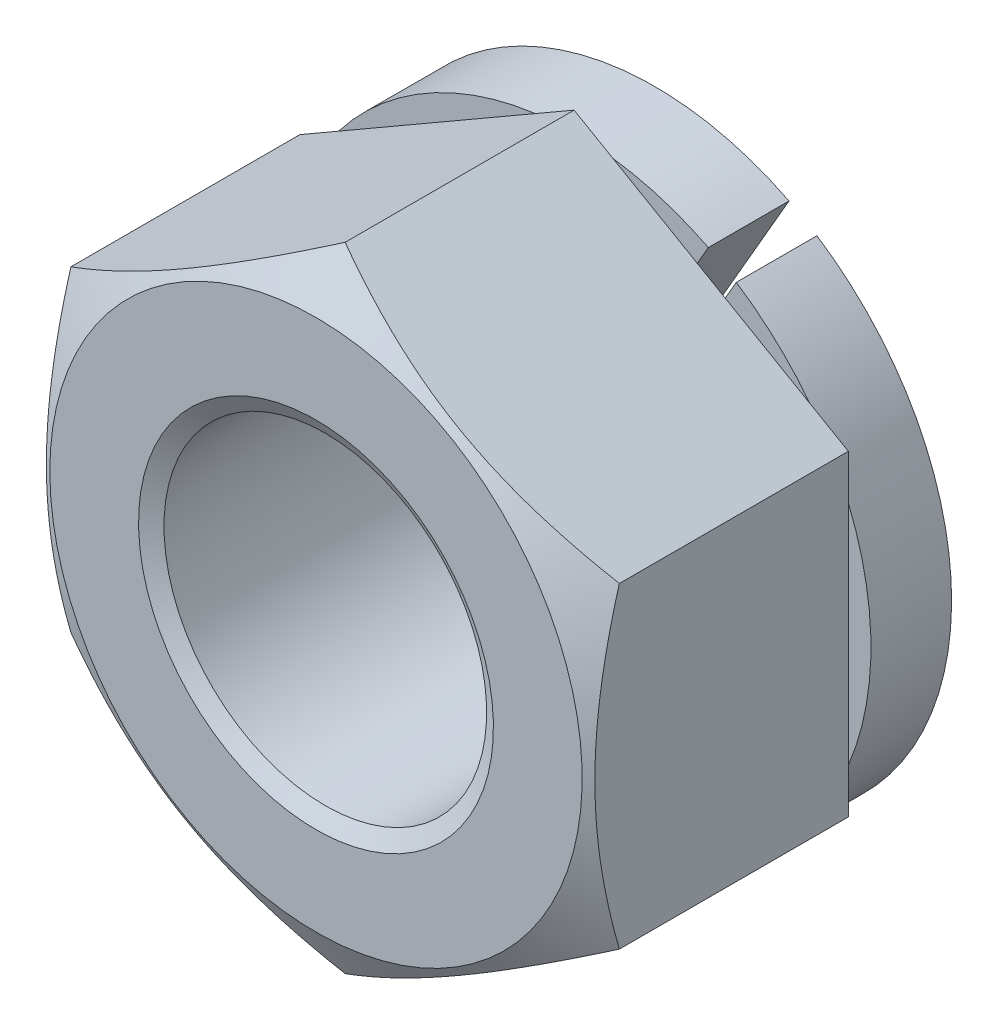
ISO-10303-21;
HEADER;
FILE_DESCRIPTION(('STEP AP214'),'2;1');
FILE_NAME('part.step','',(''),(''),'','','');
FILE_SCHEMA(('AUTOMOTIVE_DESIGN { 1 0 10303 214 1 1 1 1 }'));
ENDSEC;
DATA;
#1=APPLICATION_CONTEXT('core data for automotive mechanical design processes');
#2=APPLICATION_PROTOCOL_DEFINITION('international standard','automotive_design',2000,#1);
#3=PRODUCT_CONTEXT('',#1,'mechanical');
#4=PRODUCT('Part','Part','',(#3));
#5=PRODUCT_RELATED_PRODUCT_CATEGORY('part','',(#4));
#6=PRODUCT_DEFINITION_FORMATION('','',#4);
#7=PRODUCT_DEFINITION_CONTEXT('part definition',#1,'design');
#8=PRODUCT_DEFINITION('design','',#6,#7);
#9=PRODUCT_DEFINITION_SHAPE('','',#8);
#10=(LENGTH_UNIT() NAMED_UNIT(*) SI_UNIT(.MILLI.,.METRE.));
#11=(NAMED_UNIT(*) PLANE_ANGLE_UNIT() SI_UNIT($,.RADIAN.));
#12=(NAMED_UNIT(*) SI_UNIT($,.STERADIAN.) SOLID_ANGLE_UNIT());
#13=UNCERTAINTY_MEASURE_WITH_UNIT(LENGTH_MEASURE(1.E-05),#10,'distance_accuracy_value','');
#14=(GEOMETRIC_REPRESENTATION_CONTEXT(3) GLOBAL_UNCERTAINTY_ASSIGNED_CONTEXT((#13)) GLOBAL_UNIT_ASSIGNED_CONTEXT((#10,
#11,#12)) REPRESENTATION_CONTEXT('',''));
#15=CARTESIAN_POINT('',(0.,0.,0.));
#16=DIRECTION('',(0.,0.,1.));
#17=DIRECTION('',(1.,0.,0.));
#18=AXIS2_PLACEMENT_3D('',#15,#16,#17);
#19=CARTESIAN_POINT('',(17.,0.,2.5));
#20=DIRECTION('',(0.,0.,1.));
#21=DIRECTION('',(-0.866025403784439,0.5,0.));
#22=AXIS2_PLACEMENT_3D('',#19,#20,#21);
#23=PLANE('',#22);
#24=CARTESIAN_POINT('',(0.,0.,2.5));
#25=DIRECTION('',(0.,0.,-1.));
#26=DIRECTION('',(-0.866025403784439,0.5,0.));
#27=AXIS2_PLACEMENT_3D('',#24,#25,#26);
#28=CIRCLE('',#27,9.2);
#29=CARTESIAN_POINT('',(7.29836021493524,5.60124434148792,2.5));
#30=VERTEX_POINT('',#29);
#31=CARTESIAN_POINT('',(8.5,3.51994318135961,2.5));
#32=VERTEX_POINT('',#31);
#33=EDGE_CURVE('E9',#30,#32,#28,.T.);
#34=ORIENTED_EDGE('',*,*,#33,.F.);
#35=DIRECTION('',(-0.866025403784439,0.5,0.));
#36=VECTOR('',#35,1.);
#37=CARTESIAN_POINT('',(8.5,4.90747728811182,2.5));
#38=LINE('',#37,#36);
#39=CARTESIAN_POINT('',(8.5,4.90747728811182,2.5));
#40=VERTEX_POINT('',#39);
#41=EDGE_CURVE('E320',#40,#30,#38,.T.);
#42=ORIENTED_EDGE('',*,*,#41,.F.);
#43=DIRECTION('',(0.,1.,0.));
#44=VECTOR('',#43,1.);
#45=CARTESIAN_POINT('',(8.5,-4.90747728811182,2.5));
#46=LINE('',#45,#44);
#47=EDGE_CURVE('E397',#32,#40,#46,.T.);
#48=ORIENTED_EDGE('',*,*,#47,.F.);
#49=EDGE_LOOP('',(#34,#42,#48));
#50=FACE_BOUND('',#49,.T.);
#51=ADVANCED_FACE('F14',(#50),#23,.F.);
#52=CARTESIAN_POINT('',(8.5,-3.51994318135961,2.5));
#53=VERTEX_POINT('',#52);
#54=CARTESIAN_POINT('',(7.29836021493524,-5.60124434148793,2.5));
#55=VERTEX_POINT('',#54);
#56=EDGE_CURVE('E24',#53,#55,#28,.T.);
#57=ORIENTED_EDGE('',*,*,#56,.F.);
#58=CARTESIAN_POINT('',(8.5,-4.90747728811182,2.5));
#59=VERTEX_POINT('',#58);
#60=EDGE_CURVE('E329',#59,#53,#46,.T.);
#61=ORIENTED_EDGE('',*,*,#60,.F.);
#62=DIRECTION('',(0.866025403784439,0.5,0.));
#63=VECTOR('',#62,1.);
#64=CARTESIAN_POINT('',(0.,-9.81495457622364,2.5));
#65=LINE('',#64,#63);
#66=EDGE_CURVE('E395',#55,#59,#65,.T.);
#67=ORIENTED_EDGE('',*,*,#66,.F.);
#68=EDGE_LOOP('',(#57,#61,#67));
#69=FACE_BOUND('',#68,.T.);
#70=ADVANCED_FACE('F284',(#69),#23,.F.);
#71=CARTESIAN_POINT('',(1.20163978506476,-9.12118752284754,2.5));
#72=VERTEX_POINT('',#71);
#73=CARTESIAN_POINT('',(-1.20163978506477,-9.12118752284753,2.5));
#74=VERTEX_POINT('',#73);
#75=EDGE_CURVE('E382',#72,#74,#28,.T.);
#76=ORIENTED_EDGE('',*,*,#75,.F.);
#77=CARTESIAN_POINT('',(0.,-9.81495457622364,2.5));
#78=VERTEX_POINT('',#77);
#79=EDGE_CURVE('E396',#78,#72,#65,.T.);
#80=ORIENTED_EDGE('',*,*,#79,.F.);
#81=DIRECTION('',(0.866025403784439,-0.5,0.));
#82=VECTOR('',#81,1.);
#83=CARTESIAN_POINT('',(-8.5,-4.90747728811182,2.5));
#84=LINE('',#83,#82);
#85=EDGE_CURVE('E338',#74,#78,#84,.T.);
#86=ORIENTED_EDGE('',*,*,#85,.F.);
#87=EDGE_LOOP('',(#76,#80,#86));
#88=FACE_BOUND('',#87,.T.);
#89=ADVANCED_FACE('F424',(#88),#23,.F.);
#90=CARTESIAN_POINT('',(-7.29836021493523,-5.60124434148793,2.5));
#91=VERTEX_POINT('',#90);
#92=CARTESIAN_POINT('',(-8.5,-3.5199431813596,2.5));
#93=VERTEX_POINT('',#92);
#94=EDGE_CURVE('E378',#91,#93,#28,.T.);
#95=ORIENTED_EDGE('',*,*,#94,.F.);
#96=CARTESIAN_POINT('',(-8.5,-4.90747728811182,2.5));
#97=VERTEX_POINT('',#96);
#98=EDGE_CURVE('E340',#97,#91,#84,.T.);
#99=ORIENTED_EDGE('',*,*,#98,.F.);
#100=DIRECTION('',(0.,-1.,0.));
#101=VECTOR('',#100,1.);
#102=CARTESIAN_POINT('',(-8.5,4.90747728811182,2.5));
#103=LINE('',#102,#101);
#104=EDGE_CURVE('E333',#93,#97,#103,.T.);
#105=ORIENTED_EDGE('',*,*,#104,.F.);
#106=EDGE_LOOP('',(#95,#99,#105));
#107=FACE_BOUND('',#106,.T.);
#108=ADVANCED_FACE('F420',(#107),#23,.F.);
#109=CARTESIAN_POINT('',(-8.5,3.51994318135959,2.5));
#110=VERTEX_POINT('',#109);
#111=CARTESIAN_POINT('',(-7.29836021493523,5.60124434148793,2.5));
#112=VERTEX_POINT('',#111);
#113=EDGE_CURVE('E376',#110,#112,#28,.T.);
#114=ORIENTED_EDGE('',*,*,#113,.F.);
#115=CARTESIAN_POINT('',(-8.5,4.90747728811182,2.5));
#116=VERTEX_POINT('',#115);
#117=EDGE_CURVE('E335',#116,#110,#103,.T.);
#118=ORIENTED_EDGE('',*,*,#117,.F.);
#119=DIRECTION('',(-0.866025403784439,-0.5,0.));
#120=VECTOR('',#119,1.);
#121=CARTESIAN_POINT('',(0.,9.81495457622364,2.5));
#122=LINE('',#121,#120);
#123=EDGE_CURVE('E328',#112,#116,#122,.T.);
#124=ORIENTED_EDGE('',*,*,#123,.F.);
#125=EDGE_LOOP('',(#114,#118,#124));
#126=FACE_BOUND('',#125,.T.);
#127=ADVANCED_FACE('F431',(#126),#23,.F.);
#128=CARTESIAN_POINT('',(-1.20163978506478,9.12118752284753,2.5));
#129=VERTEX_POINT('',#128);
#130=CARTESIAN_POINT('',(1.20163978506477,9.12118752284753,2.5));
#131=VERTEX_POINT('',#130);
#132=EDGE_CURVE('E144',#129,#131,#28,.T.);
#133=ORIENTED_EDGE('',*,*,#132,.F.);
#134=CARTESIAN_POINT('',(0.,9.81495457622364,2.5));
#135=VERTEX_POINT('',#134);
#136=EDGE_CURVE('E330',#135,#129,#122,.T.);
#137=ORIENTED_EDGE('',*,*,#136,.F.);
#138=EDGE_CURVE('E325',#131,#135,#38,.T.);
#139=ORIENTED_EDGE('',*,*,#138,.F.);
#140=EDGE_LOOP('',(#133,#137,#139));
#141=FACE_BOUND('',#140,.T.);
#142=ADVANCED_FACE('F407',(#141),#23,.F.);
#143=CARTESIAN_POINT('',(0.,0.,2.5));
#144=DIRECTION('',(0.,0.,1.));
#145=DIRECTION('',(0.866025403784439,-0.5,0.));
#146=AXIS2_PLACEMENT_3D('',#143,#144,#145);
#147=CIRCLE('',#146,5.);
#148=CARTESIAN_POINT('',(4.3301270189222,-2.5,2.5));
#149=VERTEX_POINT('',#148);
#150=EDGE_CURVE('E149',#149,#149,#147,.T.);
#151=ORIENTED_EDGE('',*,*,#150,.T.);
#152=EDGE_LOOP('',(#151));
#153=FACE_BOUND('',#152,.T.);
#154=DIRECTION('',(0.5,0.866025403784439,0.));
#155=VECTOR('',#154,1.);
#156=CARTESIAN_POINT('',(2.97072820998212,4.14545219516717,2.5));
#157=LINE('',#156,#155);
#158=CARTESIAN_POINT('',(2.97072820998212,4.14545219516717,2.5));
#159=VERTEX_POINT('',#158);
#160=CARTESIAN_POINT('',(4.68301270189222,7.11121593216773,2.5));
#161=VERTEX_POINT('',#160);
#162=EDGE_CURVE('E33',#159,#161,#157,.T.);
#163=ORIENTED_EDGE('',*,*,#162,.F.);
#164=CARTESIAN_POINT('',(0.,0.,2.5));
#165=DIRECTION('',(0.,0.,1.));
#166=DIRECTION('',(-0.866025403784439,0.5,0.));
#167=AXIS2_PLACEMENT_3D('',#164,#165,#166);
#168=CIRCLE('',#167,5.1);
#169=CARTESIAN_POINT('',(2.10470280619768,4.64545219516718,2.5));
#170=VERTEX_POINT('',#169);
#171=EDGE_CURVE('E37',#170,#159,#168,.T.);
#172=ORIENTED_EDGE('',*,*,#171,.F.);
#173=DIRECTION('',(-0.5,-0.866025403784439,0.));
#174=VECTOR('',#173,1.);
#175=CARTESIAN_POINT('',(2.10470280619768,4.64545219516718,2.5));
#176=LINE('',#175,#174);
#177=CARTESIAN_POINT('',(3.81698729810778,7.61121593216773,2.5));
#178=VERTEX_POINT('',#177);
#179=EDGE_CURVE('E159',#178,#170,#176,.T.);
#180=ORIENTED_EDGE('',*,*,#179,.F.);
#181=EDGE_CURVE('E317',#161,#178,#38,.T.);
#182=ORIENTED_EDGE('',*,*,#181,.F.);
#183=EDGE_LOOP('',(#163,#172,#180,#182));
#184=FACE_BOUND('',#183,.T.);
#185=ADVANCED_FACE('F249',(#153,#184),#23,.F.);
#186=CARTESIAN_POINT('',(0.,-9.81495457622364,10.5));
#187=DIRECTION('',(-0.5,0.866025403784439,0.));
#188=DIRECTION('',(-0.866025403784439,-0.5,0.));
#189=AXIS2_PLACEMENT_3D('',#186,#187,#188);
#190=PLANE('',#189);
#191=CARTESIAN_POINT('',(-0.000200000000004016,-9.81507004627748,9.59640638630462));
#192=CARTESIAN_POINT('',(0.186639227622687,-9.70719836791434,9.65867629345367));
#193=CARTESIAN_POINT('',(0.374175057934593,-9.59892450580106,9.71812013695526));
#194=CARTESIAN_POINT('',(0.750769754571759,-9.3814974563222,9.83057732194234));
#195=CARTESIAN_POINT('',(0.939829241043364,-9.27234391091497,9.88358788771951));
#196=CARTESIAN_POINT('',(1.5100347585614,-8.94313560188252,10.0319290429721));
#197=CARTESIAN_POINT('',(1.89343164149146,-8.72178130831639,10.1163035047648));
#198=CARTESIAN_POINT('',(2.46717766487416,-8.39052888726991,10.2152424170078));
#199=CARTESIAN_POINT('',(2.65581276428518,-8.28162036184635,10.2434272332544));
#200=CARTESIAN_POINT('',(3.03393602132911,-8.06331079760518,10.2906883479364));
#201=CARTESIAN_POINT('',(3.22342410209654,-7.95390980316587,10.3097654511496));
#202=CARTESIAN_POINT('',(3.6027265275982,-7.73491944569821,10.3383276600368));
#203=CARTESIAN_POINT('',(3.79254025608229,-7.62533043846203,10.3478236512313));
#204=CARTESIAN_POINT('',(4.17234305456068,-7.40605119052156,10.3570200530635));
#205=CARTESIAN_POINT('',(4.36233211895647,-7.29636095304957,10.3567207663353));
#206=CARTESIAN_POINT('',(4.71752301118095,-7.09129139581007,10.3470079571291));
#207=CARTESIAN_POINT('',(4.8827499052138,-6.99589760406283,10.338779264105));
#208=CARTESIAN_POINT('',(5.21281671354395,-6.80533344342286,10.3150731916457));
#209=CARTESIAN_POINT('',(5.37765660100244,-6.71016309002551,10.2995953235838));
#210=CARTESIAN_POINT('',(5.87153810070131,-6.42502047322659,10.242653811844));
#211=CARTESIAN_POINT('',(6.19970550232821,-6.23555293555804,10.190689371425));
#212=CARTESIAN_POINT('',(6.85952142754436,-5.8546080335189,10.0607774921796));
#213=CARTESIAN_POINT('',(7.19108574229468,-5.66317928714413,9.98227936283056));
#214=CARTESIAN_POINT('',(7.84926989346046,-5.28317649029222,9.80412109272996));
#215=CARTESIAN_POINT('',(8.17589815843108,-5.09459757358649,9.70450279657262));
#216=CARTESIAN_POINT('',(8.5002,-4.90736181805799,9.59640638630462));
#217=B_SPLINE_CURVE_WITH_KNOTS('',3,(#191,#192,#193,#194,#195,#196,#197,#198,#199,#200,#201,
#202,#203,#204,#205,#206,#207,#208,#209,#210,#211,#212,#213,#214,#215,#216),.UNSPECIFIED.,.F.,
.F.,(4,2,2,2,2,2,2,2,2,2,2,2,4),(0.,0.67359639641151,1.34748239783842,2.69805431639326,
3.356799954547,4.01548737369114,4.67342558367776,5.33134346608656,5.9040955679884,
6.47688628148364,7.62328361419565,8.79510569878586,9.9646274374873),.UNSPECIFIED.);
#218=CARTESIAN_POINT('',(4.21537804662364E-13,-9.81495457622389,9.59647305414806));
#219=VERTEX_POINT('',#218);
#220=CARTESIAN_POINT('',(8.5,-4.90747728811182,9.59647305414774));
#221=VERTEX_POINT('',#220);
#222=EDGE_CURVE('E232',#219,#221,#217,.T.);
#223=ORIENTED_EDGE('',*,*,#222,.F.);
#224=DIRECTION('',(0.,0.,-1.));
#225=VECTOR('',#224,1.);
#226=CARTESIAN_POINT('',(0.,-9.81495457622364,10.5));
#227=LINE('',#226,#225);
#228=EDGE_CURVE('E343',#219,#78,#227,.T.);
#229=ORIENTED_EDGE('',*,*,#228,.T.);
#230=ORIENTED_EDGE('',*,*,#79,.T.);
#231=EDGE_CURVE('E393',#72,#55,#65,.T.);
#232=ORIENTED_EDGE('',*,*,#231,.T.);
#233=ORIENTED_EDGE('',*,*,#66,.T.);
#234=DIRECTION('',(0.,0.,-1.));
#235=VECTOR('',#234,1.);
#236=CARTESIAN_POINT('',(8.5,-4.90747728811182,10.5));
#237=LINE('',#236,#235);
#238=EDGE_CURVE('E357',#221,#59,#237,.T.);
#239=ORIENTED_EDGE('',*,*,#238,.F.);
#240=EDGE_LOOP('',(#223,#229,#230,#232,#233,#239));
#241=FACE_BOUND('',#240,.T.);
#242=ADVANCED_FACE('F16',(#241),#190,.F.);
#243=CARTESIAN_POINT('',(8.5,-4.90747728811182,10.5));
#244=DIRECTION('',(-1.,0.,0.));
#245=DIRECTION('',(0.,-1.,0.));
#246=AXIS2_PLACEMENT_3D('',#243,#244,#245);
#247=PLANE('',#246);
#248=CARTESIAN_POINT('',(8.5,-4.9077082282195,9.59640638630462));
#249=CARTESIAN_POINT('',(8.5,-4.69196487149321,9.65867629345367));
#250=CARTESIAN_POINT('',(8.5,-4.47541714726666,9.71812013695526));
#251=CARTESIAN_POINT('',(8.5,-4.04056304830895,9.83057732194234));
#252=CARTESIAN_POINT('',(8.5,-3.82225595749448,9.88358788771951));
#253=CARTESIAN_POINT('',(8.5,-3.16383933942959,10.0319290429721));
#254=CARTESIAN_POINT('',(8.5,-2.72113075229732,10.1163035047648));
#255=CARTESIAN_POINT('',(8.5,-2.05862591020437,10.2152424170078));
#256=CARTESIAN_POINT('',(8.5,-1.84080885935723,10.2434272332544));
#257=CARTESIAN_POINT('',(8.5,-1.4041897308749,10.2906883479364));
#258=CARTESIAN_POINT('',(8.5,-1.18538774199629,10.3097654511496));
#259=CARTESIAN_POINT('',(8.5,-0.74740702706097,10.3383276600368));
#260=CARTESIAN_POINT('',(8.5,-0.528229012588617,10.3478236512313));
#261=CARTESIAN_POINT('',(8.5,-0.0896705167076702,10.3570200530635));
#262=CARTESIAN_POINT('',(8.5,0.129709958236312,10.3567207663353));
#263=CARTESIAN_POINT('',(8.5,0.539849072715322,10.3470079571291));
#264=CARTESIAN_POINT('',(8.5,0.730636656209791,10.338779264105));
#265=CARTESIAN_POINT('',(8.5,1.11176497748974,10.3150731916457));
#266=CARTESIAN_POINT('',(8.5,1.30210568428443,10.2995953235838));
#267=CARTESIAN_POINT('',(8.5,1.87239091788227,10.2426538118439));
#268=CARTESIAN_POINT('',(8.5,2.25132599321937,10.190689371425));
#269=CARTESIAN_POINT('',(8.5,3.01321579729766,10.0607774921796));
#270=CARTESIAN_POINT('',(8.50000000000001,3.3960732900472,9.98227936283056));
#271=CARTESIAN_POINT('',(8.50000000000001,4.15607888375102,9.80412109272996));
#272=CARTESIAN_POINT('',(8.5,4.53323671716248,9.70450279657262));
#273=CARTESIAN_POINT('',(8.5,4.90770822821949,9.59640638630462));
#274=B_SPLINE_CURVE_WITH_KNOTS('',3,(#248,#249,#250,#251,#252,#253,#254,#255,#256,#257,#258,
#259,#260,#261,#262,#263,#264,#265,#266,#267,#268,#269,#270,#271,#272,#273),.UNSPECIFIED.,.F.,
.F.,(4,2,2,2,2,2,2,2,2,2,2,2,4),(0.,0.673596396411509,1.34748239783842,2.69805431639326,
3.356799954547,4.01548737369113,4.67342558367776,5.33134346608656,5.9040955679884,
6.47688628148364,7.62328361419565,8.79510569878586,9.9646274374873),.UNSPECIFIED.);
#275=CARTESIAN_POINT('',(8.50000000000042,4.90747728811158,9.59647305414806));
#276=VERTEX_POINT('',#275);
#277=EDGE_CURVE('E226',#221,#276,#274,.T.);
#278=ORIENTED_EDGE('',*,*,#277,.F.);
#279=ORIENTED_EDGE('',*,*,#238,.T.);
#280=ORIENTED_EDGE('',*,*,#60,.T.);
#281=EDGE_CURVE('E399',#53,#32,#46,.T.);
#282=ORIENTED_EDGE('',*,*,#281,.T.);
#283=ORIENTED_EDGE('',*,*,#47,.T.);
#284=DIRECTION('',(0.,0.,-1.));
#285=VECTOR('',#284,1.);
#286=CARTESIAN_POINT('',(8.5,4.90747728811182,10.5));
#287=LINE('',#286,#285);
#288=EDGE_CURVE('E356',#276,#40,#287,.T.);
#289=ORIENTED_EDGE('',*,*,#288,.F.);
#290=EDGE_LOOP('',(#278,#279,#280,#282,#283,#289));
#291=FACE_BOUND('',#290,.T.);
#292=ADVANCED_FACE('F238',(#291),#247,.F.);
#293=CARTESIAN_POINT('',(8.5,4.90747728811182,10.5));
#294=DIRECTION('',(-0.5,-0.866025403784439,0.));
#295=DIRECTION('',(0.866025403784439,-0.5,0.));
#296=AXIS2_PLACEMENT_3D('',#293,#294,#295);
#297=PLANE('',#296);
#298=CARTESIAN_POINT('',(15.8142211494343,0.684609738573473,6.12424334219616));
#299=CARTESIAN_POINT('',(15.4914354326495,0.870970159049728,6.30572777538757));
#300=CARTESIAN_POINT('',(15.1679244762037,1.05774929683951,6.48552089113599));
#301=CARTESIAN_POINT('',(14.519066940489,1.43236736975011,6.84077657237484));
#302=CARTESIAN_POINT('',(14.1937200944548,1.62020645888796,7.01623848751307));
#303=CARTESIAN_POINT('',(13.5391993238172,1.99809420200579,7.36273035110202));
#304=CARTESIAN_POINT('',(13.2100142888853,2.18814927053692,7.53373241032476));
#305=CARTESIAN_POINT('',(12.5490774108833,2.56974135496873,7.86896358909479));
#306=CARTESIAN_POINT('',(12.2173256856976,2.76127830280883,8.03319301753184));
#307=CARTESIAN_POINT('',(11.5394647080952,3.15264152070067,8.35850173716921));
#308=CARTESIAN_POINT('',(11.1932490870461,3.35252920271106,8.51928709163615));
#309=CARTESIAN_POINT('',(10.4968232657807,3.75461083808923,8.82909825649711));
#310=CARTESIAN_POINT('',(10.1466126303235,3.95680504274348,8.97812277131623));
#311=CARTESIAN_POINT('',(9.44224434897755,4.36347225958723,9.26062461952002));
#312=CARTESIAN_POINT('',(9.08809583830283,4.56793999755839,9.39413200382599));
#313=CARTESIAN_POINT('',(8.37473292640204,4.9798002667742,9.64143042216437));
#314=CARTESIAN_POINT('',(8.01552011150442,5.1871918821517,9.75522748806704));
#315=CARTESIAN_POINT('',(7.29378938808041,5.60388330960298,9.95713727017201));
#316=CARTESIAN_POINT('',(6.93130283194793,5.81316502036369,10.0453954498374));
#317=CARTESIAN_POINT('',(6.38415659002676,6.12906005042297,10.1548976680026));
#318=CARTESIAN_POINT('',(6.20119275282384,6.23469427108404,10.187585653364));
#319=CARTESIAN_POINT('',(5.83430614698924,6.44651635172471,10.2446966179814));
#320=CARTESIAN_POINT('',(5.65038347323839,6.55270415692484,10.2691203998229));
#321=CARTESIAN_POINT('',(5.28429292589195,6.76406663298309,10.3089008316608));
#322=CARTESIAN_POINT('',(5.10213465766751,6.86923575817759,10.3243748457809));
#323=CARTESIAN_POINT('',(4.73741413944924,7.07980724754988,10.3464066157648));
#324=CARTESIAN_POINT('',(4.55485189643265,7.18520960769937,10.3529645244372));
#325=CARTESIAN_POINT('',(4.1896506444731,7.3960586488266,10.3570069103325));
#326=CARTESIAN_POINT('',(4.00701163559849,7.50150532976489,10.3544913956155));
#327=CARTESIAN_POINT('',(3.64199144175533,7.71224983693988,10.3404504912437));
#328=CARTESIAN_POINT('',(3.45961026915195,7.81754765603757,10.3289246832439));
#329=CARTESIAN_POINT('',(3.02571368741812,8.06805796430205,10.2910339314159));
#330=CARTESIAN_POINT('',(2.77445373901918,8.21312296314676,10.2606779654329));
#331=CARTESIAN_POINT('',(2.27371429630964,8.50222501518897,10.1844828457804));
#332=CARTESIAN_POINT('',(2.02423503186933,8.64626193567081,10.1386417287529));
#333=CARTESIAN_POINT('',(1.27880130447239,9.07663829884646,9.98031317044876));
#334=CARTESIAN_POINT('',(0.786108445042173,9.3610946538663,9.84704608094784));
#335=CARTESIAN_POINT('',(0.0491823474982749,9.78655913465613,9.61469791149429));
#336=CARTESIAN_POINT('',(-0.198843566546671,9.92975696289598,9.53072185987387));
#337=CARTESIAN_POINT('',(-0.692489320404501,10.2147634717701,9.35373387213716));
#338=CARTESIAN_POINT('',(-0.938109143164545,10.3565721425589,9.26072187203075));
#339=CARTESIAN_POINT('',(-1.42701501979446,10.6388420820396,9.06718020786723));
#340=CARTESIAN_POINT('',(-1.67030174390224,10.7793037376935,8.96665278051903));
#341=CARTESIAN_POINT('',(-2.15484112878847,11.0590526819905,8.7592942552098));
#342=CARTESIAN_POINT('',(-2.39609382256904,11.1983399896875,8.65246325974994));
#343=CARTESIAN_POINT('',(-2.99876936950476,11.5462948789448,8.37798646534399));
#344=CARTESIAN_POINT('',(-3.3590463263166,11.754300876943,8.20699065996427));
#345=CARTESIAN_POINT('',(-4.07623316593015,12.1683688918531,7.85580015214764));
#346=CARTESIAN_POINT('',(-4.43314276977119,12.3744307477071,7.67560469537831));
#347=CARTESIAN_POINT('',(-5.14428186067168,12.7850070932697,7.30799828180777));
#348=CARTESIAN_POINT('',(-5.49851052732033,12.989521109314,7.12058521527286));
#349=CARTESIAN_POINT('',(-6.20466807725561,13.3972213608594,6.7401152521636));
#350=CARTESIAN_POINT('',(-6.55659702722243,13.6004076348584,6.5470585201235));
#351=CARTESIAN_POINT('',(-7.25903614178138,14.0059610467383,6.15617112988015));
#352=CARTESIAN_POINT('',(-7.60954378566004,14.2083267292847,5.95833444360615));
#353=CARTESIAN_POINT('',(-8.30899197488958,14.6121533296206,5.55900103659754));
#354=CARTESIAN_POINT('',(-8.65793251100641,14.8136142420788,5.35750429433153));
#355=CARTESIAN_POINT('',(-9.35444504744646,15.2157459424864,4.95155296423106));
#356=CARTESIAN_POINT('',(-9.70201726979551,15.4164168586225,4.74709888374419));
#357=CARTESIAN_POINT('',(-10.3960612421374,15.8171233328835,4.33571385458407));
#358=CARTESIAN_POINT('',(-10.7425329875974,16.0171588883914,4.12878289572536));
#359=CARTESIAN_POINT('',(-11.7159511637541,16.5791621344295,3.54373271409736));
#360=CARTESIAN_POINT('',(-12.3418362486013,16.9405170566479,3.16325922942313));
#361=CARTESIAN_POINT('',(-13.5913433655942,17.6619203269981,2.39732055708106));
#362=CARTESIAN_POINT('',(-14.2149652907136,18.0219686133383,2.01185513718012));
#363=CARTESIAN_POINT('',(-15.4586208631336,18.7399934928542,1.23828349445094));
#364=CARTESIAN_POINT('',(-16.0786596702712,19.0979730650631,0.850188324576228));
#365=CARTESIAN_POINT('',(-17.0076663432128,19.6343353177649,0.265874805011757));
#366=CARTESIAN_POINT('',(-17.3171499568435,19.8130157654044,0.0707482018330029));
#367=CARTESIAN_POINT('',(-17.9358087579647,20.1701985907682,-0.320154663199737));
#368=CARTESIAN_POINT('',(-18.2449839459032,20.3487009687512,-0.515930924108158));
#369=CARTESIAN_POINT('',(-18.5540230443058,20.5271247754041,-0.71199327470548));
#370=B_SPLINE_CURVE_WITH_KNOTS('',3,(#298,#299,#300,#301,#302,#303,#304,#305,#306,#307,#308,
#309,#310,#311,#312,#313,#314,#315,#316,#317,#318,#319,#320,#321,#322,#323,#324,#325,#326,#327,
#328,#329,#330,#331,#332,#333,#334,#335,#336,#337,#338,#339,#340,#341,#342,#343,#344,#345,#346,
#347,#348,#349,#350,#351,#352,#353,#354,#355,#356,#357,#358,#359,#360,#361,#362,#363,#364,#365,
#366,#367,#368,#369),.UNSPECIFIED.,.F.,.F.,(4,2,2,2,2,2,2,2,2,2,2,2,2,2,2,2,2,2,2,2,2,2,2,2,2,2,
2,2,2,2,2,2,2,2,2,4),(0.,1.24368507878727,2.48755578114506,3.73791418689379,4.98821550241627,
6.28076294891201,7.57345258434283,8.86359550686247,10.1533429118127,11.4355927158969,
12.0768034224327,12.7179518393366,13.3504898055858,13.9830169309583,14.615543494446,
15.2480994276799,16.1227499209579,16.9975113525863,18.7479255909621,19.6432065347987,
20.5384938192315,21.4335157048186,22.3285230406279,23.6777187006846,25.0270251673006,
26.3767290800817,27.726393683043,29.0778597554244,30.4293337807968,31.7805786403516,
33.1318290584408,35.5820289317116,38.0323432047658,40.4754749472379,41.6969615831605,
42.9184464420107),.UNSPECIFIED.);
#371=CARTESIAN_POINT('',(0.,9.81495457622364,9.59647305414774));
#372=VERTEX_POINT('',#371);
#373=EDGE_CURVE('E220',#276,#372,#370,.T.);
#374=ORIENTED_EDGE('',*,*,#373,.F.);
#375=ORIENTED_EDGE('',*,*,#288,.T.);
#376=ORIENTED_EDGE('',*,*,#41,.T.);
#377=EDGE_CURVE('E315',#30,#161,#38,.T.);
#378=ORIENTED_EDGE('',*,*,#377,.T.);
#379=ORIENTED_EDGE('',*,*,#181,.T.);
#380=EDGE_CURVE('E154',#178,#131,#38,.T.);
#381=ORIENTED_EDGE('',*,*,#380,.T.);
#382=ORIENTED_EDGE('',*,*,#138,.T.);
#383=DIRECTION('',(0.,0.,-1.));
#384=VECTOR('',#383,1.);
#385=CARTESIAN_POINT('',(0.,9.81495457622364,10.5));
#386=LINE('',#385,#384);
#387=EDGE_CURVE('E353',#372,#135,#386,.T.);
#388=ORIENTED_EDGE('',*,*,#387,.F.);
#389=EDGE_LOOP('',(#374,#375,#376,#378,#379,#381,#382,#388));
#390=FACE_BOUND('',#389,.T.);
#391=ADVANCED_FACE('F211',(#390),#297,.F.);
#392=CARTESIAN_POINT('',(0.,9.81495457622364,10.5));
#393=DIRECTION('',(0.5,-0.866025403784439,0.));
#394=DIRECTION('',(0.866025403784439,0.5,0.));
#395=AXIS2_PLACEMENT_3D('',#392,#393,#394);
#396=PLANE('',#395);
#397=CARTESIAN_POINT('',(0.000199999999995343,9.81507004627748,9.59640638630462));
#398=CARTESIAN_POINT('',(-0.186639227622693,9.70719836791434,9.65867629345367));
#399=CARTESIAN_POINT('',(-0.374175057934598,9.59892450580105,9.71812013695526));
#400=CARTESIAN_POINT('',(-0.750769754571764,9.3814974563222,9.83057732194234));
#401=CARTESIAN_POINT('',(-0.939829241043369,9.27234391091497,9.88358788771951));
#402=CARTESIAN_POINT('',(-1.5100347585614,8.94313560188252,10.0319290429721));
#403=CARTESIAN_POINT('',(-1.89343164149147,8.72178130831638,10.1163035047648));
#404=CARTESIAN_POINT('',(-2.46717766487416,8.39052888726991,10.2152424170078));
#405=CARTESIAN_POINT('',(-2.65581276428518,8.28162036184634,10.2434272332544));
#406=CARTESIAN_POINT('',(-3.03393602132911,8.06331079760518,10.2906883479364));
#407=CARTESIAN_POINT('',(-3.22342410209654,7.95390980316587,10.3097654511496));
#408=CARTESIAN_POINT('',(-3.6027265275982,7.73491944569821,10.3383276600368));
#409=CARTESIAN_POINT('',(-3.7925402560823,7.62533043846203,10.3478236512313));
#410=CARTESIAN_POINT('',(-4.17234305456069,7.40605119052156,10.3570200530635));
#411=CARTESIAN_POINT('',(-4.36233211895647,7.29636095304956,10.3567207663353));
#412=CARTESIAN_POINT('',(-4.71752301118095,7.09129139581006,10.3470079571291));
#413=CARTESIAN_POINT('',(-4.8827499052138,6.99589760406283,10.338779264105));
#414=CARTESIAN_POINT('',(-5.21281671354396,6.80533344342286,10.3150731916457));
#415=CARTESIAN_POINT('',(-5.37765660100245,6.71016309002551,10.2995953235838));
#416=CARTESIAN_POINT('',(-5.87153810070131,6.42502047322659,10.242653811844));
#417=CARTESIAN_POINT('',(-6.19970550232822,6.23555293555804,10.190689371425));
#418=CARTESIAN_POINT('',(-6.85952142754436,5.8546080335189,10.0607774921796));
#419=CARTESIAN_POINT('',(-7.19108574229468,5.66317928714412,9.98227936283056));
#420=CARTESIAN_POINT('',(-7.84926989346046,5.28317649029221,9.80412109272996));
#421=CARTESIAN_POINT('',(-8.17589815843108,5.09459757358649,9.70450279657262));
#422=CARTESIAN_POINT('',(-8.5002,4.90736181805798,9.59640638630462));
#423=B_SPLINE_CURVE_WITH_KNOTS('',3,(#397,#398,#399,#400,#401,#402,#403,#404,#405,#406,#407,
#408,#409,#410,#411,#412,#413,#414,#415,#416,#417,#418,#419,#420,#421,#422),.UNSPECIFIED.,.F.,
.F.,(4,2,2,2,2,2,2,2,2,2,2,2,4),(0.,0.673596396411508,1.34748239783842,2.69805431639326,
3.356799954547,4.01548737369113,4.67342558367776,5.33134346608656,5.9040955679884,
6.47688628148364,7.62328361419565,8.79510569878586,9.9646274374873),.UNSPECIFIED.);
#424=CARTESIAN_POINT('',(-8.5,4.90747728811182,9.59647305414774));
#425=VERTEX_POINT('',#424);
#426=EDGE_CURVE('E214',#372,#425,#423,.T.);
#427=ORIENTED_EDGE('',*,*,#426,.F.);
#428=ORIENTED_EDGE('',*,*,#387,.T.);
#429=ORIENTED_EDGE('',*,*,#136,.T.);
#430=EDGE_CURVE('E334',#129,#112,#122,.T.);
#431=ORIENTED_EDGE('',*,*,#430,.T.);
#432=ORIENTED_EDGE('',*,*,#123,.T.);
#433=DIRECTION('',(0.,0.,-1.));
#434=VECTOR('',#433,1.);
#435=CARTESIAN_POINT('',(-8.5,4.90747728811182,10.5));
#436=LINE('',#435,#434);
#437=EDGE_CURVE('E350',#425,#116,#436,.T.);
#438=ORIENTED_EDGE('',*,*,#437,.F.);
#439=EDGE_LOOP('',(#427,#428,#429,#431,#432,#438));
#440=FACE_BOUND('',#439,.T.);
#441=ADVANCED_FACE('F206',(#440),#396,.F.);
#442=CARTESIAN_POINT('',(-8.5,4.90747728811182,10.5));
#443=DIRECTION('',(1.,0.,0.));
#444=DIRECTION('',(0.,1.,0.));
#445=AXIS2_PLACEMENT_3D('',#442,#443,#444);
#446=PLANE('',#445);
#447=CARTESIAN_POINT('',(-8.5,4.90770822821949,9.59640638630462));
#448=CARTESIAN_POINT('',(-8.5,4.69196487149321,9.65867629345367));
#449=CARTESIAN_POINT('',(-8.5,4.47541714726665,9.71812013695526));
#450=CARTESIAN_POINT('',(-8.5,4.04056304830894,9.83057732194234));
#451=CARTESIAN_POINT('',(-8.5,3.82225595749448,9.88358788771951));
#452=CARTESIAN_POINT('',(-8.5,3.16383933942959,10.0319290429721));
#453=CARTESIAN_POINT('',(-8.5,2.72113075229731,10.1163035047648));
#454=CARTESIAN_POINT('',(-8.5,2.05862591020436,10.2152424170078));
#455=CARTESIAN_POINT('',(-8.5,1.84080885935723,10.2434272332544));
#456=CARTESIAN_POINT('',(-8.5,1.40418973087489,10.2906883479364));
#457=CARTESIAN_POINT('',(-8.5,1.18538774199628,10.3097654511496));
#458=CARTESIAN_POINT('',(-8.5,0.747407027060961,10.3383276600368));
#459=CARTESIAN_POINT('',(-8.5,0.528229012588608,10.3478236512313));
#460=CARTESIAN_POINT('',(-8.5,0.0896705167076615,10.3570200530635));
#461=CARTESIAN_POINT('',(-8.5,-0.129709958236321,10.3567207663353));
#462=CARTESIAN_POINT('',(-8.5,-0.539849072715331,10.3470079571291));
#463=CARTESIAN_POINT('',(-8.5,-0.730636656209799,10.338779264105));
#464=CARTESIAN_POINT('',(-8.5,-1.11176497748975,10.3150731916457));
#465=CARTESIAN_POINT('',(-8.5,-1.30210568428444,10.2995953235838));
#466=CARTESIAN_POINT('',(-8.5,-1.87239091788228,10.242653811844));
#467=CARTESIAN_POINT('',(-8.5,-2.25132599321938,10.190689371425));
#468=CARTESIAN_POINT('',(-8.5,-3.01321579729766,10.0607774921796));
#469=CARTESIAN_POINT('',(-8.50000000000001,-3.3960732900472,9.98227936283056));
#470=CARTESIAN_POINT('',(-8.50000000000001,-4.15607888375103,9.80412109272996));
#471=CARTESIAN_POINT('',(-8.5,-4.53323671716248,9.70450279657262));
#472=CARTESIAN_POINT('',(-8.5,-4.90770822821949,9.59640638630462));
#473=B_SPLINE_CURVE_WITH_KNOTS('',3,(#447,#448,#449,#450,#451,#452,#453,#454,#455,#456,#457,
#458,#459,#460,#461,#462,#463,#464,#465,#466,#467,#468,#469,#470,#471,#472),.UNSPECIFIED.,.F.,
.F.,(4,2,2,2,2,2,2,2,2,2,2,2,4),(0.,0.673596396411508,1.34748239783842,2.69805431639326,
3.356799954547,4.01548737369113,4.67342558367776,5.33134346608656,5.9040955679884,
6.47688628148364,7.62328361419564,8.79510569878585,9.96462743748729),.UNSPECIFIED.);
#474=CARTESIAN_POINT('',(-8.5,-4.90747728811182,9.59647305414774));
#475=VERTEX_POINT('',#474);
#476=EDGE_CURVE('E185',#425,#475,#473,.T.);
#477=ORIENTED_EDGE('',*,*,#476,.F.);
#478=ORIENTED_EDGE('',*,*,#437,.T.);
#479=ORIENTED_EDGE('',*,*,#117,.T.);
#480=EDGE_CURVE('E339',#110,#93,#103,.T.);
#481=ORIENTED_EDGE('',*,*,#480,.T.);
#482=ORIENTED_EDGE('',*,*,#104,.T.);
#483=DIRECTION('',(0.,0.,-1.));
#484=VECTOR('',#483,1.);
#485=CARTESIAN_POINT('',(-8.5,-4.90747728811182,10.5));
#486=LINE('',#485,#484);
#487=EDGE_CURVE('E347',#475,#97,#486,.T.);
#488=ORIENTED_EDGE('',*,*,#487,.F.);
#489=EDGE_LOOP('',(#477,#478,#479,#481,#482,#488));
#490=FACE_BOUND('',#489,.T.);
#491=ADVANCED_FACE('F200',(#490),#446,.F.);
#492=CARTESIAN_POINT('',(-8.5,-4.90747728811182,10.5));
#493=DIRECTION('',(0.5,0.866025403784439,0.));
#494=DIRECTION('',(-0.866025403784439,0.5,0.));
#495=AXIS2_PLACEMENT_3D('',#492,#493,#494);
#496=PLANE('',#495);
#497=CARTESIAN_POINT('',(7.3142211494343,-14.037822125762,6.12424334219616));
#498=CARTESIAN_POINT('',(6.99143543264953,-13.8514617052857,6.30572777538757));
#499=CARTESIAN_POINT('',(6.66792447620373,-13.664682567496,6.48552089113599));
#500=CARTESIAN_POINT('',(6.01906694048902,-13.2900644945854,6.84077657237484));
#501=CARTESIAN_POINT('',(5.69372009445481,-13.1022254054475,7.01623848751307));
#502=CARTESIAN_POINT('',(5.03919932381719,-12.7243376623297,7.36273035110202));
#503=CARTESIAN_POINT('',(4.71001428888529,-12.5342825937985,7.53373241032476));
#504=CARTESIAN_POINT('',(4.04907741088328,-12.1526905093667,7.86896358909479));
#505=CARTESIAN_POINT('',(3.71732568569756,-11.9611535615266,8.03319301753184));
#506=CARTESIAN_POINT('',(3.03946470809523,-11.5697903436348,8.35850173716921));
#507=CARTESIAN_POINT('',(2.69324908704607,-11.3699026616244,8.51928709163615));
#508=CARTESIAN_POINT('',(1.99682326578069,-10.9678210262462,8.82909825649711));
#509=CARTESIAN_POINT('',(1.64661263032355,-10.765626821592,8.97812277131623));
#510=CARTESIAN_POINT('',(0.942244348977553,-10.3589596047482,9.26062461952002));
#511=CARTESIAN_POINT('',(0.588095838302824,-10.1544918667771,9.39413200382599));
#512=CARTESIAN_POINT('',(-0.125267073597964,-9.74263159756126,9.64143042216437));
#513=CARTESIAN_POINT('',(-0.484479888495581,-9.53523998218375,9.75522748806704));
#514=CARTESIAN_POINT('',(-1.2062106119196,-9.11854855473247,9.95713727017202));
#515=CARTESIAN_POINT('',(-1.56869716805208,-8.90926684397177,10.0453954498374));
#516=CARTESIAN_POINT('',(-2.11584340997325,-8.59337181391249,10.1548976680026));
#517=CARTESIAN_POINT('',(-2.29880724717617,-8.48773759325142,10.187585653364));
#518=CARTESIAN_POINT('',(-2.66569385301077,-8.27591551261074,10.2446966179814));
#519=CARTESIAN_POINT('',(-2.84961652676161,-8.16972770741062,10.2691203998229));
#520=CARTESIAN_POINT('',(-3.21570707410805,-7.95836523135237,10.3089008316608));
#521=CARTESIAN_POINT('',(-3.3978653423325,-7.85319610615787,10.3243748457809));
#522=CARTESIAN_POINT('',(-3.76258586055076,-7.64262461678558,10.3464066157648));
#523=CARTESIAN_POINT('',(-3.94514810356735,-7.53722225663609,10.3529645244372));
#524=CARTESIAN_POINT('',(-4.3103493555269,-7.32637321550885,10.3570069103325));
#525=CARTESIAN_POINT('',(-4.49298836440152,-7.22092653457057,10.3544913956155));
#526=CARTESIAN_POINT('',(-4.85800855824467,-7.01018202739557,10.3404504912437));
#527=CARTESIAN_POINT('',(-5.04038973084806,-6.90488420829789,10.3289246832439));
#528=CARTESIAN_POINT('',(-5.47428631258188,-6.65437390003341,10.2910339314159));
#529=CARTESIAN_POINT('',(-5.72554626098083,-6.5093089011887,10.2606779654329));
#530=CARTESIAN_POINT('',(-6.22628570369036,-6.22020684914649,10.1844828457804));
#531=CARTESIAN_POINT('',(-6.47576496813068,-6.07616992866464,10.1386417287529));
#532=CARTESIAN_POINT('',(-7.22119869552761,-5.645793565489,9.98031317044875));
#533=CARTESIAN_POINT('',(-7.71389155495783,-5.36133721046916,9.84704608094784));
#534=CARTESIAN_POINT('',(-8.45081765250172,-4.93587272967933,9.61469791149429));
#535=CARTESIAN_POINT('',(-8.69884356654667,-4.79267490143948,9.53072185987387));
#536=CARTESIAN_POINT('',(-9.1924893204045,-4.50766839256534,9.35373387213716));
#537=CARTESIAN_POINT('',(-9.43810914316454,-4.36585972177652,9.26072187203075));
#538=CARTESIAN_POINT('',(-9.92701501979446,-4.08358978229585,9.06718020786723));
#539=CARTESIAN_POINT('',(-10.1703017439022,-3.94312812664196,8.96665278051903));
#540=CARTESIAN_POINT('',(-10.6548411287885,-3.66337918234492,8.7592942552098));
#541=CARTESIAN_POINT('',(-10.896093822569,-3.52409187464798,8.65246325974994));
#542=CARTESIAN_POINT('',(-11.4987693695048,-3.17613698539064,8.37798646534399));
#543=CARTESIAN_POINT('',(-11.8590463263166,-2.96813098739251,8.20699065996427));
#544=CARTESIAN_POINT('',(-12.5762331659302,-2.55406297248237,7.85580015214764));
#545=CARTESIAN_POINT('',(-12.9331427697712,-2.34800111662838,7.67560469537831));
#546=CARTESIAN_POINT('',(-13.6442818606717,-1.93742477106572,7.30799828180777));
#547=CARTESIAN_POINT('',(-13.9985105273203,-1.73291075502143,7.12058521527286));
#548=CARTESIAN_POINT('',(-14.7046680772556,-1.32521050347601,6.7401152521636));
#549=CARTESIAN_POINT('',(-15.0565970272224,-1.12202422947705,6.5470585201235));
#550=CARTESIAN_POINT('',(-15.7590361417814,-0.716470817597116,6.15617112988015));
#551=CARTESIAN_POINT('',(-16.10954378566,-0.514105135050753,5.95833444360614));
#552=CARTESIAN_POINT('',(-16.8089919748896,-0.110278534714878,5.55900103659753));
#553=CARTESIAN_POINT('',(-17.1579325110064,0.0911823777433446,5.35750429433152));
#554=CARTESIAN_POINT('',(-17.8544450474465,0.493314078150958,4.95155296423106));
#555=CARTESIAN_POINT('',(-18.2020172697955,0.693984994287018,4.74709888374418));
#556=CARTESIAN_POINT('',(-18.8960612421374,1.09469146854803,4.33571385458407));
#557=CARTESIAN_POINT('',(-19.2425329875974,1.29472702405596,4.12878289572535));
#558=CARTESIAN_POINT('',(-20.2159511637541,1.85673027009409,3.54373271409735));
#559=CARTESIAN_POINT('',(-20.8418362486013,2.2180851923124,3.16325922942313));
#560=CARTESIAN_POINT('',(-22.0913433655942,2.93948846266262,2.39732055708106));
#561=CARTESIAN_POINT('',(-22.7149652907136,3.29953674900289,2.01185513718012));
#562=CARTESIAN_POINT('',(-23.9586208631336,4.01756162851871,1.23828349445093));
#563=CARTESIAN_POINT('',(-24.5786596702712,4.37554120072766,0.850188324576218));
#564=CARTESIAN_POINT('',(-25.5076663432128,4.91190345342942,0.265874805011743));
#565=CARTESIAN_POINT('',(-25.8171499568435,5.09058390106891,0.070748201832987));
#566=CARTESIAN_POINT('',(-26.4358087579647,5.44776672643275,-0.32015466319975));
#567=CARTESIAN_POINT('',(-26.7449839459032,5.62626910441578,-0.515930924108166));
#568=CARTESIAN_POINT('',(-27.0540230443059,5.80469291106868,-0.71199327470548));
#569=B_SPLINE_CURVE_WITH_KNOTS('',3,(#497,#498,#499,#500,#501,#502,#503,#504,#505,#506,#507,
#508,#509,#510,#511,#512,#513,#514,#515,#516,#517,#518,#519,#520,#521,#522,#523,#524,#525,#526,
#527,#528,#529,#530,#531,#532,#533,#534,#535,#536,#537,#538,#539,#540,#541,#542,#543,#544,#545,
#546,#547,#548,#549,#550,#551,#552,#553,#554,#555,#556,#557,#558,#559,#560,#561,#562,#563,#564,
#565,#566,#567,#568),.UNSPECIFIED.,.F.,.F.,(4,2,2,2,2,2,2,2,2,2,2,2,2,2,2,2,2,2,2,2,2,2,2,2,2,2,
2,2,2,2,2,2,2,2,2,4),(0.,1.24368507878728,2.48755578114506,3.73791418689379,4.98821550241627,
6.28076294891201,7.57345258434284,8.86359550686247,10.1533429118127,11.4355927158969,
12.0768034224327,12.7179518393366,13.3504898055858,13.9830169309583,14.615543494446,
15.2480994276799,16.1227499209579,16.9975113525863,18.7479255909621,19.6432065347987,
20.5384938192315,21.4335157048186,22.328523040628,23.6777187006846,25.0270251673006,
26.3767290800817,27.726393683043,29.0778597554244,30.4293337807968,31.7805786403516,
33.1318290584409,35.5820289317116,38.0323432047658,40.4754749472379,41.6969615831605,
42.9184464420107),.UNSPECIFIED.);
#570=EDGE_CURVE('E177',#475,#219,#569,.F.);
#571=ORIENTED_EDGE('',*,*,#570,.F.);
#572=ORIENTED_EDGE('',*,*,#487,.T.);
#573=ORIENTED_EDGE('',*,*,#98,.T.);
#574=EDGE_CURVE('E344',#91,#74,#84,.T.);
#575=ORIENTED_EDGE('',*,*,#574,.T.);
#576=ORIENTED_EDGE('',*,*,#85,.T.);
#577=ORIENTED_EDGE('',*,*,#228,.F.);
#578=EDGE_LOOP('',(#571,#572,#573,#575,#576,#577));
#579=FACE_BOUND('',#578,.T.);
#580=ADVANCED_FACE('F196',(#579),#496,.F.);
#581=CARTESIAN_POINT('',(0.,0.,10.5));
#582=DIRECTION('',(0.,0.,-1.));
#583=DIRECTION('',(0.866025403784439,-0.5,0.));
#584=AXIS2_PLACEMENT_3D('',#581,#582,#583);
#585=CONICAL_SURFACE('',#584,8.25,1.0471975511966);
#586=CARTESIAN_POINT('',(0.,0.,10.5));
#587=DIRECTION('',(0.,0.,1.));
#588=DIRECTION('',(-0.866025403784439,0.5,0.));
#589=AXIS2_PLACEMENT_3D('',#586,#587,#588);
#590=CIRCLE('',#589,8.25);
#591=CARTESIAN_POINT('',(-7.14470958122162,4.125,10.5));
#592=VERTEX_POINT('',#591);
#593=EDGE_CURVE('E168',#592,#592,#590,.T.);
#594=ORIENTED_EDGE('',*,*,#593,.F.);
#595=EDGE_LOOP('',(#594));
#596=FACE_BOUND('',#595,.T.);
#597=ORIENTED_EDGE('',*,*,#222,.T.);
#598=ORIENTED_EDGE('',*,*,#277,.T.);
#599=ORIENTED_EDGE('',*,*,#373,.T.);
#600=ORIENTED_EDGE('',*,*,#426,.T.);
#601=ORIENTED_EDGE('',*,*,#476,.T.);
#602=ORIENTED_EDGE('',*,*,#570,.T.);
#603=EDGE_LOOP('',(#597,#598,#599,#600,#601,#602));
#604=FACE_BOUND('',#603,.T.);
#605=ADVANCED_FACE('F192',(#596,#604),#585,.T.);
#606=CARTESIAN_POINT('',(17.,0.,10.5));
#607=DIRECTION('',(0.,0.,1.));
#608=DIRECTION('',(-0.866025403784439,0.5,0.));
#609=AXIS2_PLACEMENT_3D('',#606,#607,#608);
#610=PLANE('',#609);
#611=CARTESIAN_POINT('',(0.,0.,10.5));
#612=DIRECTION('',(0.,0.,1.));
#613=DIRECTION('',(-0.866025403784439,0.5,0.));
#614=AXIS2_PLACEMENT_3D('',#611,#612,#613);
#615=CIRCLE('',#614,5.5);
#616=CARTESIAN_POINT('',(-4.76313972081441,2.75,10.5));
#617=VERTEX_POINT('',#616);
#618=EDGE_CURVE('E164',#617,#617,#615,.T.);
#619=ORIENTED_EDGE('',*,*,#618,.F.);
#620=EDGE_LOOP('',(#619));
#621=FACE_BOUND('',#620,.T.);
#622=ORIENTED_EDGE('',*,*,#593,.T.);
#623=EDGE_LOOP('',(#622));
#624=FACE_BOUND('',#623,.T.);
#625=ADVANCED_FACE('F202',(#621,#624),#610,.T.);
#626=CARTESIAN_POINT('',(0.,0.,10.5));
#627=DIRECTION('',(0.,0.,1.));
#628=DIRECTION('',(-0.866025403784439,0.5,0.));
#629=AXIS2_PLACEMENT_3D('',#626,#627,#628);
#630=CONICAL_SURFACE('',#629,5.5,1.0471975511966);
#631=CARTESIAN_POINT('',(0.,0.,10.2113248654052));
#632=DIRECTION('',(0.,0.,1.));
#633=DIRECTION('',(0.866025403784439,-0.5,0.));
#634=AXIS2_PLACEMENT_3D('',#631,#632,#633);
#635=CIRCLE('',#634,5.);
#636=CARTESIAN_POINT('',(4.3301270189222,-2.5,10.2113248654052));
#637=VERTEX_POINT('',#636);
#638=EDGE_CURVE('E19',#637,#637,#635,.F.);
#639=ORIENTED_EDGE('',*,*,#638,.T.);
#640=EDGE_LOOP('',(#639));
#641=FACE_BOUND('',#640,.T.);
#642=ORIENTED_EDGE('',*,*,#618,.T.);
#643=EDGE_LOOP('',(#642));
#644=FACE_BOUND('',#643,.T.);
#645=ADVANCED_FACE('F266',(#641,#644),#630,.F.);
#646=CARTESIAN_POINT('',(0.,0.,0.));
#647=DIRECTION('',(0.,0.,-1.));
#648=DIRECTION('',(-0.866025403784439,0.5,0.));
#649=AXIS2_PLACEMENT_3D('',#646,#647,#648);
#650=PLANE('',#649);
#651=CARTESIAN_POINT('',(0.,0.,0.));
#652=DIRECTION('',(0.,0.,-1.));
#653=DIRECTION('',(-0.866025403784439,0.5,0.));
#654=AXIS2_PLACEMENT_3D('',#651,#652,#653);
#655=CIRCLE('',#654,9.2);
#656=CARTESIAN_POINT('',(5.02621419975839,7.70565836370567,0.));
#657=VERTEX_POINT('',#656);
#658=CARTESIAN_POINT('',(4.16018879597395,8.20565836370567,0.));
#659=VERTEX_POINT('',#658);
#660=EDGE_CURVE('E324',#657,#659,#655,.T.);
#661=ORIENTED_EDGE('',*,*,#660,.T.);
#662=DIRECTION('',(-0.5,-0.866025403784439,0.));
#663=VECTOR('',#662,1.);
#664=CARTESIAN_POINT('',(2.10470280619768,4.64545219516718,0.));
#665=LINE('',#664,#663);
#666=CARTESIAN_POINT('',(2.10470280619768,4.64545219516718,0.));
#667=VERTEX_POINT('',#666);
#668=EDGE_CURVE('E162',#659,#667,#665,.T.);
#669=ORIENTED_EDGE('',*,*,#668,.T.);
#670=CARTESIAN_POINT('',(0.,0.,0.));
#671=DIRECTION('',(0.,0.,1.));
#672=DIRECTION('',(-0.866025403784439,0.5,0.));
#673=AXIS2_PLACEMENT_3D('',#670,#671,#672);
#674=CIRCLE('',#673,5.1);
#675=CARTESIAN_POINT('',(2.97072820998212,4.14545219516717,0.));
#676=VERTEX_POINT('',#675);
#677=EDGE_CURVE('E367',#667,#676,#674,.T.);
#678=ORIENTED_EDGE('',*,*,#677,.T.);
#679=DIRECTION('',(0.5,0.866025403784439,0.));
#680=VECTOR('',#679,1.);
#681=CARTESIAN_POINT('',(2.97072820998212,4.14545219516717,0.));
#682=LINE('',#681,#680);
#683=EDGE_CURVE('E369',#676,#657,#682,.T.);
#684=ORIENTED_EDGE('',*,*,#683,.T.);
#685=EDGE_LOOP('',(#661,#669,#678,#684));
#686=FACE_BOUND('',#685,.T.);
#687=ADVANCED_FACE('F273',(#686),#650,.T.);
#688=CARTESIAN_POINT('',(2.10470280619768,4.64545219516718,0.));
#689=DIRECTION('',(-0.866025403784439,0.5,0.));
#690=DIRECTION('',(0.5,0.866025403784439,0.));
#691=AXIS2_PLACEMENT_3D('',#688,#689,#690);
#692=PLANE('',#691);
#693=CARTESIAN_POINT('',(4.16018879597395,8.20565836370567,2.5));
#694=VERTEX_POINT('',#693);
#695=EDGE_CURVE('E152',#694,#178,#176,.T.);
#696=ORIENTED_EDGE('',*,*,#695,.T.);
#697=ORIENTED_EDGE('',*,*,#179,.T.);
#698=DIRECTION('',(0.,0.,1.));
#699=VECTOR('',#698,1.);
#700=CARTESIAN_POINT('',(2.10470280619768,4.64545219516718,0.));
#701=LINE('',#700,#699);
#702=EDGE_CURVE('E165',#667,#170,#701,.T.);
#703=ORIENTED_EDGE('',*,*,#702,.F.);
#704=ORIENTED_EDGE('',*,*,#668,.F.);
#705=DIRECTION('',(0.,0.,1.));
#706=VECTOR('',#705,1.);
#707=CARTESIAN_POINT('',(4.16018879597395,8.20565836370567,0.));
#708=LINE('',#707,#706);
#709=EDGE_CURVE('E142',#659,#694,#708,.T.);
#710=ORIENTED_EDGE('',*,*,#709,.T.);
#711=EDGE_LOOP('',(#696,#697,#703,#704,#710));
#712=FACE_BOUND('',#711,.T.);
#713=ADVANCED_FACE('F160',(#712),#692,.F.);
#714=CARTESIAN_POINT('',(0.,0.,0.));
#715=DIRECTION('',(0.,0.,1.));
#716=DIRECTION('',(0.866025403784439,-0.5,0.));
#717=AXIS2_PLACEMENT_3D('',#714,#715,#716);
#718=CYLINDRICAL_SURFACE('',#717,5.1);
#719=ORIENTED_EDGE('',*,*,#171,.T.);
#720=DIRECTION('',(0.,0.,1.));
#721=VECTOR('',#720,1.);
#722=CARTESIAN_POINT('',(2.97072820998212,4.14545219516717,0.));
#723=LINE('',#722,#721);
#724=EDGE_CURVE('E171',#676,#159,#723,.T.);
#725=ORIENTED_EDGE('',*,*,#724,.F.);
#726=ORIENTED_EDGE('',*,*,#677,.F.);
#727=ORIENTED_EDGE('',*,*,#702,.T.);
#728=EDGE_LOOP('',(#719,#725,#726,#727));
#729=FACE_BOUND('',#728,.T.);
#730=ADVANCED_FACE('F293',(#729),#718,.F.);
#731=CARTESIAN_POINT('',(2.97072820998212,4.14545219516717,0.));
#732=DIRECTION('',(0.866025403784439,-0.5,0.));
#733=DIRECTION('',(-0.5,-0.866025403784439,0.));
#734=AXIS2_PLACEMENT_3D('',#731,#732,#733);
#735=PLANE('',#734);
#736=ORIENTED_EDGE('',*,*,#162,.T.);
#737=CARTESIAN_POINT('',(5.02621419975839,7.70565836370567,2.5));
#738=VERTEX_POINT('',#737);
#739=EDGE_CURVE('E157',#161,#738,#157,.T.);
#740=ORIENTED_EDGE('',*,*,#739,.T.);
#741=DIRECTION('',(0.,0.,1.));
#742=VECTOR('',#741,1.);
#743=CARTESIAN_POINT('',(5.02621419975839,7.70565836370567,0.));
#744=LINE('',#743,#742);
#745=EDGE_CURVE('E371',#657,#738,#744,.T.);
#746=ORIENTED_EDGE('',*,*,#745,.F.);
#747=ORIENTED_EDGE('',*,*,#683,.F.);
#748=ORIENTED_EDGE('',*,*,#724,.T.);
#749=EDGE_LOOP('',(#736,#740,#746,#747,#748));
#750=FACE_BOUND('',#749,.T.);
#751=ADVANCED_FACE('F280',(#750),#735,.F.);
#752=CARTESIAN_POINT('',(0.,0.,0.));
#753=DIRECTION('',(0.,0.,1.));
#754=DIRECTION('',(0.866025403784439,-0.5,0.));
#755=AXIS2_PLACEMENT_3D('',#752,#753,#754);
#756=CYLINDRICAL_SURFACE('',#755,9.2);
#757=EDGE_CURVE('E150',#738,#30,#28,.T.);
#758=ORIENTED_EDGE('',*,*,#757,.T.);
#759=ORIENTED_EDGE('',*,*,#33,.T.);
#760=EDGE_CURVE('E26',#32,#53,#28,.T.);
#761=ORIENTED_EDGE('',*,*,#760,.T.);
#762=ORIENTED_EDGE('',*,*,#56,.T.);
#763=EDGE_CURVE('E375',#55,#72,#28,.T.);
#764=ORIENTED_EDGE('',*,*,#763,.T.);
#765=ORIENTED_EDGE('',*,*,#75,.T.);
#766=EDGE_CURVE('E394',#74,#91,#28,.T.);
#767=ORIENTED_EDGE('',*,*,#766,.T.);
#768=ORIENTED_EDGE('',*,*,#94,.T.);
#769=EDGE_CURVE('E412',#93,#110,#28,.T.);
#770=ORIENTED_EDGE('',*,*,#769,.T.);
#771=ORIENTED_EDGE('',*,*,#113,.T.);
#772=EDGE_CURVE('E148',#112,#129,#28,.T.);
#773=ORIENTED_EDGE('',*,*,#772,.T.);
#774=ORIENTED_EDGE('',*,*,#132,.T.);
#775=EDGE_CURVE('E136',#131,#694,#28,.T.);
#776=ORIENTED_EDGE('',*,*,#775,.T.);
#777=ORIENTED_EDGE('',*,*,#709,.F.);
#778=ORIENTED_EDGE('',*,*,#660,.F.);
#779=ORIENTED_EDGE('',*,*,#745,.T.);
#780=EDGE_LOOP('',(#758,#759,#761,#762,#764,#765,#767,#768,#770,#771,#773,#774,#776,#777,#778,#779));
#781=FACE_BOUND('',#780,.T.);
#782=ADVANCED_FACE('F139',(#781),#756,.T.);
#783=CARTESIAN_POINT('',(0.,0.,2.5));
#784=DIRECTION('',(0.,0.,-1.));
#785=DIRECTION('',(-0.866025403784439,0.5,0.));
#786=AXIS2_PLACEMENT_3D('',#783,#784,#785);
#787=PLANE('',#786);
#788=ORIENTED_EDGE('',*,*,#281,.F.);
#789=ORIENTED_EDGE('',*,*,#760,.F.);
#790=EDGE_LOOP('',(#788,#789));
#791=FACE_BOUND('',#790,.T.);
#792=ADVANCED_FACE('F258',(#791),#787,.F.);
#793=ORIENTED_EDGE('',*,*,#380,.F.);
#794=ORIENTED_EDGE('',*,*,#695,.F.);
#795=ORIENTED_EDGE('',*,*,#775,.F.);
#796=EDGE_LOOP('',(#793,#794,#795));
#797=FACE_BOUND('',#796,.T.);
#798=ADVANCED_FACE('F153',(#797),#787,.F.);
#799=ORIENTED_EDGE('',*,*,#377,.F.);
#800=ORIENTED_EDGE('',*,*,#757,.F.);
#801=ORIENTED_EDGE('',*,*,#739,.F.);
#802=EDGE_LOOP('',(#799,#800,#801));
#803=FACE_BOUND('',#802,.T.);
#804=ADVANCED_FACE('F279',(#803),#787,.F.);
#805=ORIENTED_EDGE('',*,*,#430,.F.);
#806=ORIENTED_EDGE('',*,*,#772,.F.);
#807=EDGE_LOOP('',(#805,#806));
#808=FACE_BOUND('',#807,.T.);
#809=ADVANCED_FACE('F410',(#808),#787,.F.);
#810=ORIENTED_EDGE('',*,*,#480,.F.);
#811=ORIENTED_EDGE('',*,*,#769,.F.);
#812=EDGE_LOOP('',(#810,#811));
#813=FACE_BOUND('',#812,.T.);
#814=ADVANCED_FACE('F267',(#813),#787,.F.);
#815=ORIENTED_EDGE('',*,*,#574,.F.);
#816=ORIENTED_EDGE('',*,*,#766,.F.);
#817=EDGE_LOOP('',(#815,#816));
#818=FACE_BOUND('',#817,.T.);
#819=ADVANCED_FACE('F255',(#818),#787,.F.);
#820=ORIENTED_EDGE('',*,*,#231,.F.);
#821=ORIENTED_EDGE('',*,*,#763,.F.);
#822=EDGE_LOOP('',(#820,#821));
#823=FACE_BOUND('',#822,.T.);
#824=ADVANCED_FACE('F252',(#823),#787,.F.);
#825=CARTESIAN_POINT('',(0.,0.,-9.5));
#826=DIRECTION('',(0.,0.,1.));
#827=DIRECTION('',(0.866025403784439,-0.5,0.));
#828=AXIS2_PLACEMENT_3D('',#825,#826,#827);
#829=CYLINDRICAL_SURFACE('',#828,5.);
#830=ORIENTED_EDGE('',*,*,#638,.F.);
#831=EDGE_LOOP('',(#830));
#832=FACE_BOUND('',#831,.T.);
#833=ORIENTED_EDGE('',*,*,#150,.F.);
#834=EDGE_LOOP('',(#833));
#835=FACE_BOUND('',#834,.T.);
#836=ADVANCED_FACE('F254',(#832,#835),#829,.F.);
#837=CLOSED_SHELL('',(#51,#70,#89,#108,#127,#142,#185,#242,#292,#391,#441,#491,#580,#605,#625,
#645,#687,#713,#730,#751,#782,#792,#798,#804,#809,#814,#819,#824,#836));
#838=MANIFOLD_SOLID_BREP('B1',#837);
#839=ADVANCED_BREP_SHAPE_REPRESENTATION('',(#18,#838),#14);
#840=SHAPE_DEFINITION_REPRESENTATION(#9,#839);
ENDSEC;
END-ISO-10303-21;
